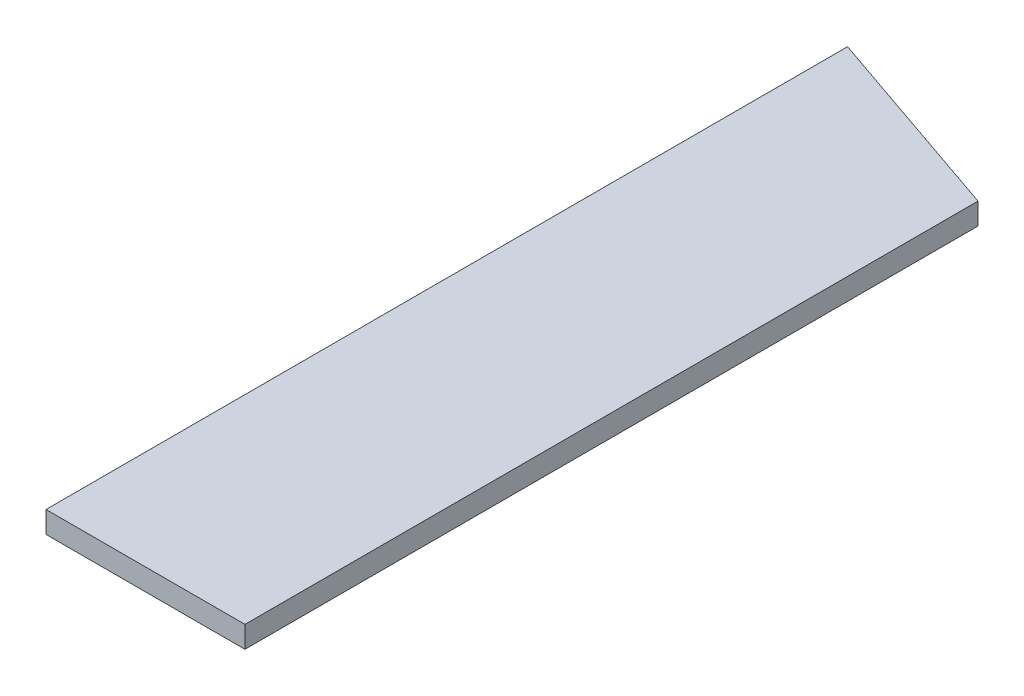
from build123d import *

# Parameters (mm, degrees)
SKETCH1_W           = 1168.4
SKETCH1_H           = 4722.60422
BOSS_EXTRUDE1_DEPTH = 127
CUT_EXTRUDE1_DEPTH  = 2436.809166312


with BuildPart() as part:
    # Sketch1 → Boss-Extrude1 (new body)
    with BuildSketch(Plane(origin=(0, 0, 0), x_dir=(1, 0, 0), z_dir=(0, 1, 0))):
        Rectangle(SKETCH1_W, SKETCH1_H)
    extrude(amount=BOSS_EXTRUDE1_DEPTH)

    # Sketch2 → Cut-Extrude1 (cut, through all)
    with BuildSketch(Plane.XZ):
        Polygon((-584.2, -2346.232135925), (-584.2, -2361.30211), (584.2, -2361.30211), (584.2, -1943.919752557), align=None)
    extrude(amount=-CUT_EXTRUDE1_DEPTH, mode=Mode.SUBTRACT)


solid = part.part
